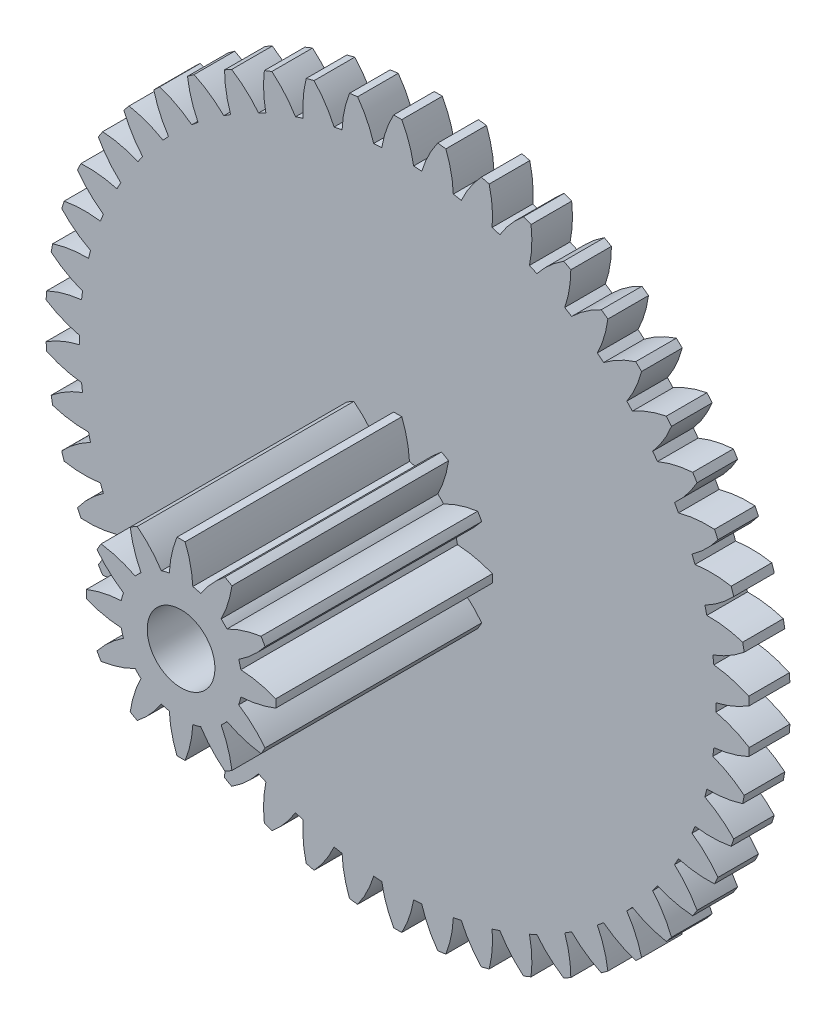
from build123d import *

# Parameters (mm, degrees)
ESQUISSE1_R                  = 13
BASE_EXTRUSION_DEPTH         = 1.5
ESQUISSE2_R                  = 3.5
BOSS_EXTRU_1_DEPTH           = 8
ENL_V_START                  = -8
ENL_V_MAT_EXTRU_1_DEPTH      = 8
R_P_TITION_CIRCULAIRE1_COUNT = 12
ENL_V_MAT_EXTRU_2_DEPTH      = 21.049937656
R_P_TITION_CIRCULAIRE2_COUNT = 50
ESQUISSE5_R                  = 1.25
ENL_V_MAT_EXTRU_3_DEPTH      = 21.683465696


with BuildPart() as part:
    # Esquisse1 → Base-Extrusion (new body)
    with BuildSketch(Plane.XY):
        Circle(ESQUISSE1_R)
    extrude(amount=BASE_EXTRUSION_DEPTH)

    # Esquisse2 → Boss.-Extru.1 (add)
    with BuildSketch(Plane.XY.offset(1.5)):
        Circle(ESQUISSE2_R)
    extrude(amount=BOSS_EXTRU_1_DEPTH)

    # Esquisse3 → Enl_v. mat.-Extru.1 (cut)
    with BuildSketch(Plane.XY.offset(9.5).offset(ENL_V_START)):
        with BuildLine():
            Line((0.582342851, 2.173333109), (1.027385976, 3.834256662))
            Line((1.027385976, 3.834256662), (-1.027385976, 3.834256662))
            Line((-1.027385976, 3.834256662), (-0.582342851, 2.173333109))
            ThreePointArc((-0.582342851, 2.173333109), (-0.508733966, 2.191732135), (-0.434546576, 2.207638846))
            ThreePointArc((-0.434546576, 2.207638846), (-0.345824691, 2.864031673), (-0.15, 3.496784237))
            ThreePointArc((-0.15, 3.496784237), (0, 3.5), (0.15, 3.496784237))
            ThreePointArc((0.15, 3.496784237), (0.345824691, 2.864031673), (0.434546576, 2.207638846))
            ThreePointArc((0.434546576, 2.207638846), (0.508733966, 2.191732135), (0.582342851, 2.173333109))
        make_face()
    enl_v_mat_extru_1 = extrude(amount=ENL_V_MAT_EXTRU_1_DEPTH, mode=Mode.SUBTRACT)

    # R_p_tition circulaire1: Enl_v. mat.-Extru.1 ×12 about axis
    r_p_tition_circulaire1_axis = Axis((0, 0, 0), (0, 0, -1))
    for i in range(1, R_P_TITION_CIRCULAIRE1_COUNT):
        add(enl_v_mat_extru_1.rotate(r_p_tition_circulaire1_axis, i * 360 / R_P_TITION_CIRCULAIRE1_COUNT), mode=Mode.SUBTRACT)

    # Esquisse4 → Enl_v. mat.-Extru.2 (cut, through all)
    with BuildSketch(Plane.XY.offset(1.5)):
        with BuildLine():
            Line((0.737788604, 11.726814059), (0.86725698, 13.784654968))
            Line((0.86725698, 13.784654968), (-0.86725698, 13.784654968))
            Line((-0.86725698, 13.784654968), (-0.737788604, 11.726814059))
            ThreePointArc((-0.737788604, 11.726814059), (-0.662920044, 11.731284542), (-0.588024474, 11.735277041))
            ThreePointArc((-0.588024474, 11.735277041), (-0.422216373, 12.385645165), (-0.15, 12.999134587))
            ThreePointArc((-0.15, 12.999134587), (0, 13), (0.15, 12.999134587))
            ThreePointArc((0.15, 12.999134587), (0.422216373, 12.385645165), (0.588024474, 11.735277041))
            ThreePointArc((0.588024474, 11.735277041), (0.662920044, 11.731284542), (0.737788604, 11.726814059))
        make_face()
    enl_v_mat_extru_2 = extrude(amount=-ENL_V_MAT_EXTRU_2_DEPTH, mode=Mode.SUBTRACT)

    # R_p_tition circulaire2: Enl_v. mat.-Extru.2 ×50 about axis
    r_p_tition_circulaire2_axis = Axis((0, 0, 0), (0, 0, -1))
    for i in range(1, R_P_TITION_CIRCULAIRE2_COUNT):
        add(enl_v_mat_extru_2.rotate(r_p_tition_circulaire2_axis, i * 360 / R_P_TITION_CIRCULAIRE2_COUNT), mode=Mode.SUBTRACT)

    # Esquisse5 → Enl_v. mat.-Extru.3 (cut, through all)
    with BuildSketch(Plane.XY.offset(9.5)):
        Circle(ESQUISSE5_R)
    extrude(amount=-ENL_V_MAT_EXTRU_3_DEPTH, mode=Mode.SUBTRACT)


solid = part.part
